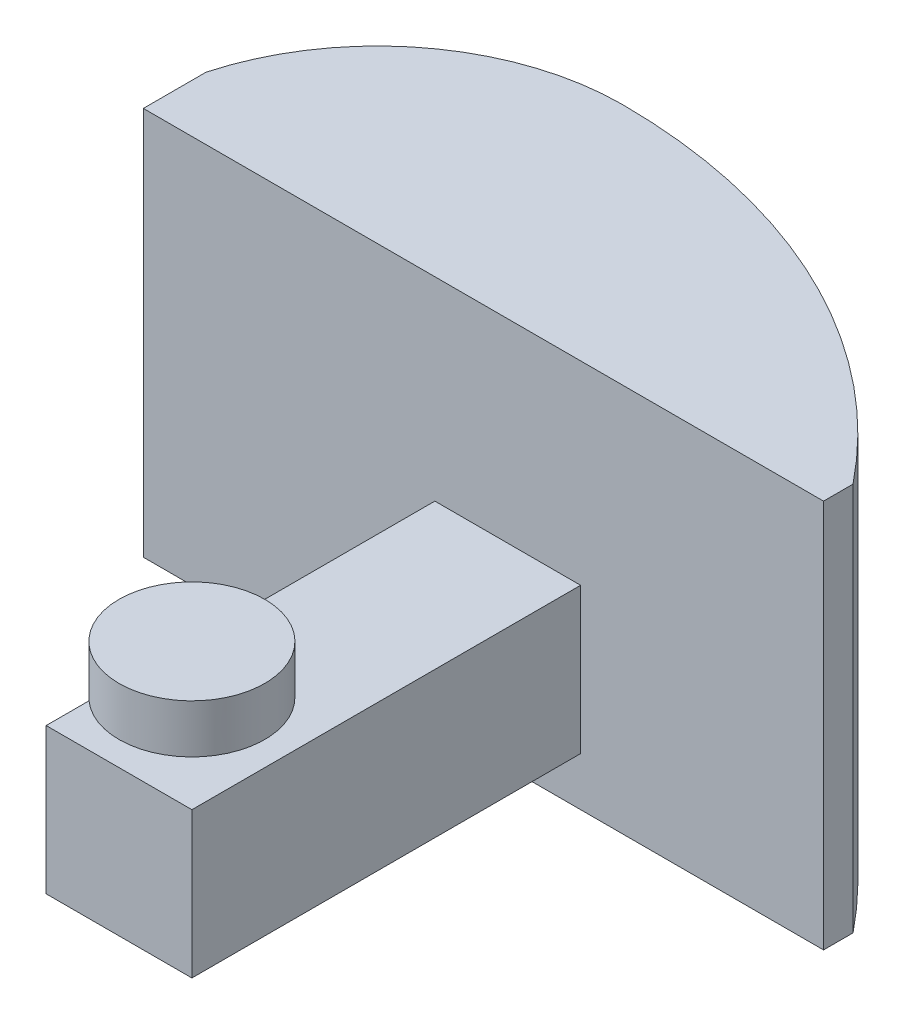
from build123d import *

# Parameters (mm, degrees)
ESQUISSE1_W             = 3
ESQUISSE1_H             = 3
BASE_EXTRUSION_DEPTH    = 8
ESQUISSE2_W             = 14
ESQUISSE2_H             = 8
BOSS_EXTRU_1_DEPTH      = 5
ENL_V_MAT_EXTRU_1_DEPTH = 19.788294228
ESQUISSE4_R             = 1.5
BOSS_EXTRU_2_DEPTH      = 1


with BuildPart() as part:
    # Esquisse1 → Base-Extrusion (new body)
    with BuildSketch(Plane.XY):
        with Locations((-7.5, 18.5)):
            Rectangle(ESQUISSE1_W, ESQUISSE1_H)
    extrude(amount=BASE_EXTRUSION_DEPTH)

    # Esquisse2 → Boss.-Extru.1 (add)
    with BuildSketch(Plane(origin=(0, 0, 0), x_dir=(-1, 0, 0), z_dir=(0, 0, -1))):
        with Locations((8, 20)):
            Rectangle(ESQUISSE2_W, ESQUISSE2_H)
    extrude(amount=BOSS_EXTRU_1_DEPTH)

    # Esquisse3 → Enl_v. mat.-Extru.1 (cut, through all)
    with BuildSketch(Plane.XZ.offset(-16)):
        with BuildLine():
            Line((-15, -1.291463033), (-16.400732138, -1.291463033))
            Line((-16.400732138, -1.291463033), (-16.400732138, -7.629651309))
            Line((-16.400732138, -7.629651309), (1.312073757, -7.629651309))
            Line((1.312073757, -7.629651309), (1.312073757, -0.606488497))
            Line((1.312073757, -0.606488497), (-1, -0.606488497))
            ThreePointArc((-1, -0.606488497), (-5.063682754, -3.839030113), (-10.124808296, -5))
            ThreePointArc((-10.124808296, -5), (-13.189837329, -3.970546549), (-15, -1.291463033))
        make_face()
    extrude(amount=-ENL_V_MAT_EXTRU_1_DEPTH, mode=Mode.SUBTRACT)

    # Esquisse4 → Boss.-Extru.2 (add)
    with BuildSketch(Plane(origin=(0, 20, 0), x_dir=(-1, 0, 0), z_dir=(0, 1, 0))):
        with Locations(Location((8, 6, 0), (0, 0, 311.810314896))):
            Circle(ESQUISSE4_R)
    extrude(amount=BOSS_EXTRU_2_DEPTH)


solid = part.part
